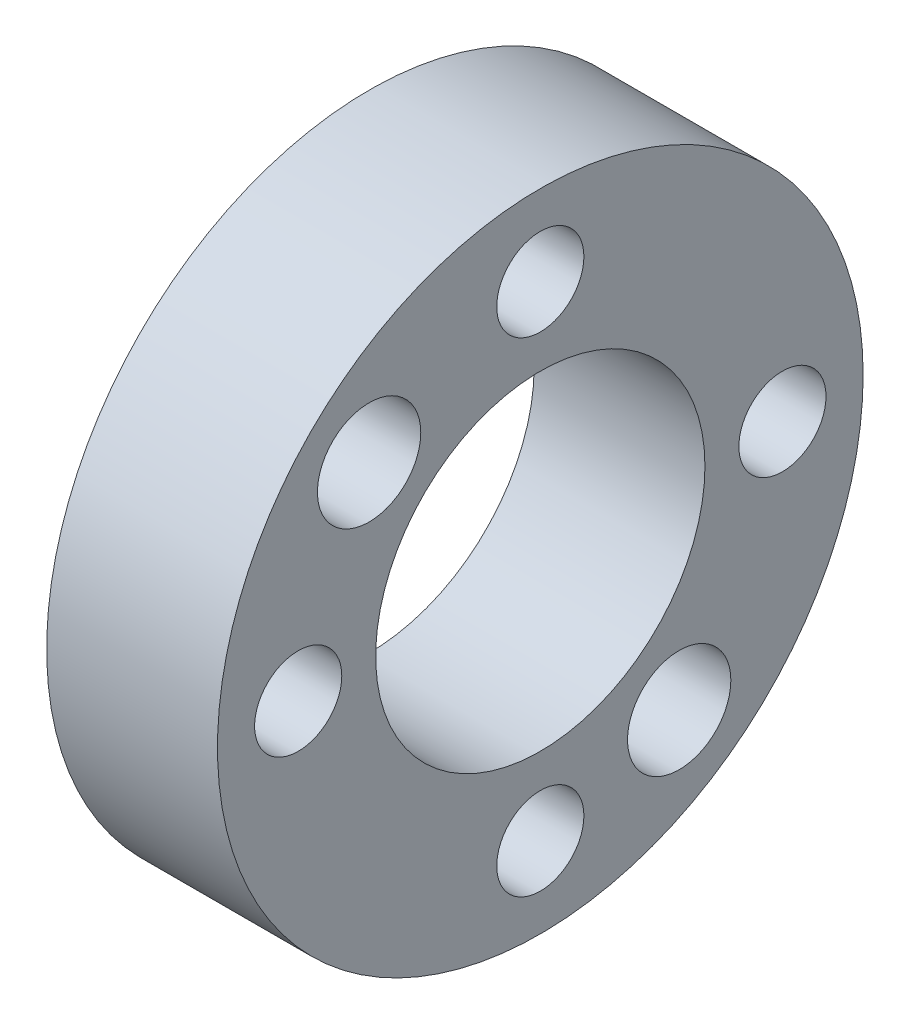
ISO-10303-21;
HEADER;
FILE_DESCRIPTION(('STEP AP214'),'2;1');
FILE_NAME('part.step','',(''),(''),'','','');
FILE_SCHEMA(('AUTOMOTIVE_DESIGN { 1 0 10303 214 1 1 1 1 }'));
ENDSEC;
DATA;
#1=APPLICATION_CONTEXT('core data for automotive mechanical design processes');
#2=APPLICATION_PROTOCOL_DEFINITION('international standard','automotive_design',2000,#1);
#3=PRODUCT_CONTEXT('',#1,'mechanical');
#4=PRODUCT('Part','Part','',(#3));
#5=PRODUCT_RELATED_PRODUCT_CATEGORY('part','',(#4));
#6=PRODUCT_DEFINITION_FORMATION('','',#4);
#7=PRODUCT_DEFINITION_CONTEXT('part definition',#1,'design');
#8=PRODUCT_DEFINITION('design','',#6,#7);
#9=PRODUCT_DEFINITION_SHAPE('','',#8);
#10=(LENGTH_UNIT() NAMED_UNIT(*) SI_UNIT(.MILLI.,.METRE.));
#11=(NAMED_UNIT(*) PLANE_ANGLE_UNIT() SI_UNIT($,.RADIAN.));
#12=(NAMED_UNIT(*) SI_UNIT($,.STERADIAN.) SOLID_ANGLE_UNIT());
#13=UNCERTAINTY_MEASURE_WITH_UNIT(LENGTH_MEASURE(1.E-05),#10,'distance_accuracy_value','');
#14=(GEOMETRIC_REPRESENTATION_CONTEXT(3) GLOBAL_UNCERTAINTY_ASSIGNED_CONTEXT((#13)) GLOBAL_UNIT_ASSIGNED_CONTEXT((#10,
#11,#12)) REPRESENTATION_CONTEXT('',''));
#15=CARTESIAN_POINT('',(0.,0.,0.));
#16=DIRECTION('',(0.,0.,1.));
#17=DIRECTION('',(1.,0.,0.));
#18=AXIS2_PLACEMENT_3D('',#15,#16,#17);
#19=CARTESIAN_POINT('',(0.,5.10000000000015,0.));
#20=DIRECTION('',(-1.,0.,0.));
#21=DIRECTION('',(0.,0.,1.00000000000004));
#22=AXIS2_PLACEMENT_3D('',#19,#20,#21);
#23=PLANE('',#22);
#24=CARTESIAN_POINT('',(0.,-6.14364033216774,-4.30182327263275));
#25=DIRECTION('',(1.,0.,0.));
#26=DIRECTION('',(0.,0.,-1.00000000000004));
#27=AXIS2_PLACEMENT_3D('',#24,#25,#26);
#28=CIRCLE('',#27,1.6);
#29=CARTESIAN_POINT('',(0.,-6.14364033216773,-5.90182327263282));
#30=VERTEX_POINT('',#29);
#31=EDGE_CURVE('E79',#30,#30,#28,.T.);
#32=ORIENTED_EDGE('',*,*,#31,.T.);
#33=EDGE_LOOP('',(#32));
#34=FACE_BOUND('',#33,.T.);
#35=CARTESIAN_POINT('',(0.,5.30330085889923,5.30330085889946));
#36=DIRECTION('',(1.,0.,0.));
#37=DIRECTION('',(0.,0.,-1.00000000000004));
#38=AXIS2_PLACEMENT_3D('',#35,#36,#37);
#39=CIRCLE('',#38,1.6);
#40=CARTESIAN_POINT('',(0.,5.30330085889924,3.70330085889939));
#41=VERTEX_POINT('',#40);
#42=EDGE_CURVE('E75',#41,#41,#39,.T.);
#43=ORIENTED_EDGE('',*,*,#42,.T.);
#44=EDGE_LOOP('',(#43));
#45=FACE_BOUND('',#44,.T.);
#46=CARTESIAN_POINT('',(0.,1.15195735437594E-13,-7.49999999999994));
#47=DIRECTION('',(1.,0.,0.));
#48=DIRECTION('',(0.,0.,-1.00000000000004));
#49=AXIS2_PLACEMENT_3D('',#46,#47,#48);
#50=CIRCLE('',#49,1.35);
#51=CARTESIAN_POINT('',(0.,1.21790460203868E-13,-8.84999999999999));
#52=VERTEX_POINT('',#51);
#53=EDGE_CURVE('E69',#52,#52,#50,.T.);
#54=ORIENTED_EDGE('',*,*,#53,.T.);
#55=EDGE_LOOP('',(#54));
#56=FACE_BOUND('',#55,.T.);
#57=CARTESIAN_POINT('',(0.,-7.5000000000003,0.));
#58=DIRECTION('',(1.,0.,0.));
#59=DIRECTION('',(0.,0.,-1.00000000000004));
#60=AXIS2_PLACEMENT_3D('',#57,#58,#59);
#61=CIRCLE('',#60,1.35);
#62=CARTESIAN_POINT('',(0.,-7.5000000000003,-1.35000000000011));
#63=VERTEX_POINT('',#62);
#64=EDGE_CURVE('E63',#63,#63,#61,.T.);
#65=ORIENTED_EDGE('',*,*,#64,.T.);
#66=EDGE_LOOP('',(#65));
#67=FACE_BOUND('',#66,.T.);
#68=CARTESIAN_POINT('',(0.,0.,7.5000000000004));
#69=DIRECTION('',(1.,0.,0.));
#70=DIRECTION('',(0.,0.,-1.00000000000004));
#71=AXIS2_PLACEMENT_3D('',#68,#69,#70);
#72=CIRCLE('',#71,1.35);
#73=CARTESIAN_POINT('',(0.,0.,6.15000000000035));
#74=VERTEX_POINT('',#73);
#75=EDGE_CURVE('E57',#74,#74,#72,.T.);
#76=ORIENTED_EDGE('',*,*,#75,.T.);
#77=EDGE_LOOP('',(#76));
#78=FACE_BOUND('',#77,.T.);
#79=CARTESIAN_POINT('',(0.,7.5000000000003,0.));
#80=DIRECTION('',(1.,0.,0.));
#81=DIRECTION('',(0.,0.,-1.00000000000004));
#82=AXIS2_PLACEMENT_3D('',#79,#80,#81);
#83=CIRCLE('',#82,1.35);
#84=CARTESIAN_POINT('',(0.,7.50000000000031,-1.35000000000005));
#85=VERTEX_POINT('',#84);
#86=EDGE_CURVE('E51',#85,#85,#83,.T.);
#87=ORIENTED_EDGE('',*,*,#86,.T.);
#88=EDGE_LOOP('',(#87));
#89=FACE_BOUND('',#88,.T.);
#90=CARTESIAN_POINT('',(0.,0.,0.));
#91=DIRECTION('',(1.,0.,0.));
#92=DIRECTION('',(0.,0.,-1.00000000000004));
#93=AXIS2_PLACEMENT_3D('',#90,#91,#92);
#94=CIRCLE('',#93,5.1);
#95=CARTESIAN_POINT('',(0.,0.,-5.1000000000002));
#96=VERTEX_POINT('',#95);
#97=EDGE_CURVE('E46',#96,#96,#94,.T.);
#98=ORIENTED_EDGE('',*,*,#97,.T.);
#99=EDGE_LOOP('',(#98));
#100=FACE_BOUND('',#99,.T.);
#101=CARTESIAN_POINT('',(0.,0.,0.));
#102=DIRECTION('',(1.,0.,0.));
#103=DIRECTION('',(0.,0.,-1.00000000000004));
#104=AXIS2_PLACEMENT_3D('',#101,#102,#103);
#105=CIRCLE('',#104,10.);
#106=CARTESIAN_POINT('',(0.,0.,-10.0000000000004));
#107=VERTEX_POINT('',#106);
#108=EDGE_CURVE('E10',#107,#107,#105,.T.);
#109=ORIENTED_EDGE('',*,*,#108,.F.);
#110=EDGE_LOOP('',(#109));
#111=FACE_BOUND('',#110,.T.);
#112=ADVANCED_FACE('F32',(#34,#45,#56,#67,#78,#89,#100,#111),#23,.T.);
#113=CARTESIAN_POINT('',(0.,0.,0.));
#114=DIRECTION('',(1.,0.,0.));
#115=DIRECTION('',(0.,0.,-1.00000000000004));
#116=AXIS2_PLACEMENT_3D('',#113,#114,#115);
#117=CYLINDRICAL_SURFACE('',#116,10.);
#118=ORIENTED_EDGE('',*,*,#108,.T.);
#119=EDGE_LOOP('',(#118));
#120=FACE_BOUND('',#119,.T.);
#121=CARTESIAN_POINT('',(5.29099999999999,0.,0.));
#122=DIRECTION('',(1.,0.,0.));
#123=DIRECTION('',(0.,0.,-1.00000000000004));
#124=AXIS2_PLACEMENT_3D('',#121,#122,#123);
#125=CIRCLE('',#124,10.);
#126=CARTESIAN_POINT('',(5.29099999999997,0.,-10.0000000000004));
#127=VERTEX_POINT('',#126);
#128=EDGE_CURVE('E38',#127,#127,#125,.T.);
#129=ORIENTED_EDGE('',*,*,#128,.F.);
#130=EDGE_LOOP('',(#129));
#131=FACE_BOUND('',#130,.T.);
#132=ADVANCED_FACE('F101',(#120,#131),#117,.T.);
#133=CARTESIAN_POINT('',(5.29099999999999,5.10000000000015,0.));
#134=DIRECTION('',(1.,0.,0.));
#135=DIRECTION('',(0.,0.,-1.00000000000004));
#136=AXIS2_PLACEMENT_3D('',#133,#134,#135);
#137=PLANE('',#136);
#138=CARTESIAN_POINT('',(5.29099999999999,-6.14364033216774,-4.30182327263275));
#139=DIRECTION('',(1.,0.,0.));
#140=DIRECTION('',(0.,0.,-1.00000000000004));
#141=AXIS2_PLACEMENT_3D('',#138,#139,#140);
#142=CIRCLE('',#141,1.6);
#143=CARTESIAN_POINT('',(5.29099999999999,-6.14364033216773,-5.90182327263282));
#144=VERTEX_POINT('',#143);
#145=EDGE_CURVE('E82',#144,#144,#142,.T.);
#146=ORIENTED_EDGE('',*,*,#145,.F.);
#147=EDGE_LOOP('',(#146));
#148=FACE_BOUND('',#147,.T.);
#149=CARTESIAN_POINT('',(5.29099999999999,5.30330085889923,5.30330085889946));
#150=DIRECTION('',(1.,0.,0.));
#151=DIRECTION('',(0.,0.,-1.00000000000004));
#152=AXIS2_PLACEMENT_3D('',#149,#150,#151);
#153=CIRCLE('',#152,1.6);
#154=CARTESIAN_POINT('',(5.29099999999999,5.30330085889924,3.70330085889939));
#155=VERTEX_POINT('',#154);
#156=EDGE_CURVE('E76',#155,#155,#153,.T.);
#157=ORIENTED_EDGE('',*,*,#156,.F.);
#158=EDGE_LOOP('',(#157));
#159=FACE_BOUND('',#158,.T.);
#160=CARTESIAN_POINT('',(5.29099999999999,1.15195735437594E-13,-7.49999999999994));
#161=DIRECTION('',(1.,0.,0.));
#162=DIRECTION('',(0.,0.,-1.00000000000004));
#163=AXIS2_PLACEMENT_3D('',#160,#161,#162);
#164=CIRCLE('',#163,1.35);
#165=CARTESIAN_POINT('',(5.29099999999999,1.21790460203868E-13,-8.85));
#166=VERTEX_POINT('',#165);
#167=EDGE_CURVE('E72',#166,#166,#164,.T.);
#168=ORIENTED_EDGE('',*,*,#167,.F.);
#169=EDGE_LOOP('',(#168));
#170=FACE_BOUND('',#169,.T.);
#171=CARTESIAN_POINT('',(5.29099999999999,-7.5000000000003,0.));
#172=DIRECTION('',(1.,0.,0.));
#173=DIRECTION('',(0.,0.,-1.00000000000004));
#174=AXIS2_PLACEMENT_3D('',#171,#172,#173);
#175=CIRCLE('',#174,1.35);
#176=CARTESIAN_POINT('',(5.29099999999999,-7.5000000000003,-1.35000000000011));
#177=VERTEX_POINT('',#176);
#178=EDGE_CURVE('E66',#177,#177,#175,.T.);
#179=ORIENTED_EDGE('',*,*,#178,.F.);
#180=EDGE_LOOP('',(#179));
#181=FACE_BOUND('',#180,.T.);
#182=CARTESIAN_POINT('',(5.29099999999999,0.,7.5000000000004));
#183=DIRECTION('',(1.,0.,0.));
#184=DIRECTION('',(0.,0.,-1.00000000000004));
#185=AXIS2_PLACEMENT_3D('',#182,#183,#184);
#186=CIRCLE('',#185,1.35);
#187=CARTESIAN_POINT('',(5.29099999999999,0.,6.15000000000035));
#188=VERTEX_POINT('',#187);
#189=EDGE_CURVE('E60',#188,#188,#186,.T.);
#190=ORIENTED_EDGE('',*,*,#189,.F.);
#191=EDGE_LOOP('',(#190));
#192=FACE_BOUND('',#191,.T.);
#193=CARTESIAN_POINT('',(5.29099999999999,7.5000000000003,0.));
#194=DIRECTION('',(1.,0.,0.));
#195=DIRECTION('',(0.,0.,-1.00000000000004));
#196=AXIS2_PLACEMENT_3D('',#193,#194,#195);
#197=CIRCLE('',#196,1.35);
#198=CARTESIAN_POINT('',(5.29099999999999,7.50000000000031,-1.35000000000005));
#199=VERTEX_POINT('',#198);
#200=EDGE_CURVE('E54',#199,#199,#197,.T.);
#201=ORIENTED_EDGE('',*,*,#200,.F.);
#202=EDGE_LOOP('',(#201));
#203=FACE_BOUND('',#202,.T.);
#204=ORIENTED_EDGE('',*,*,#128,.T.);
#205=EDGE_LOOP('',(#204));
#206=FACE_BOUND('',#205,.T.);
#207=CARTESIAN_POINT('',(5.29099999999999,0.,0.));
#208=DIRECTION('',(1.,0.,0.));
#209=DIRECTION('',(0.,0.,-1.00000000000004));
#210=AXIS2_PLACEMENT_3D('',#207,#208,#209);
#211=CIRCLE('',#210,5.1);
#212=CARTESIAN_POINT('',(5.29099999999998,0.,-5.1000000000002));
#213=VERTEX_POINT('',#212);
#214=EDGE_CURVE('E42',#213,#213,#211,.T.);
#215=ORIENTED_EDGE('',*,*,#214,.F.);
#216=EDGE_LOOP('',(#215));
#217=FACE_BOUND('',#216,.T.);
#218=ADVANCED_FACE('F97',(#148,#159,#170,#181,#192,#203,#206,#217),#137,.T.);
#219=CARTESIAN_POINT('',(0.,0.,0.));
#220=DIRECTION('',(1.,0.,0.));
#221=DIRECTION('',(0.,0.,-1.00000000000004));
#222=AXIS2_PLACEMENT_3D('',#219,#220,#221);
#223=CYLINDRICAL_SURFACE('',#222,5.1);
#224=ORIENTED_EDGE('',*,*,#214,.T.);
#225=EDGE_LOOP('',(#224));
#226=FACE_BOUND('',#225,.T.);
#227=ORIENTED_EDGE('',*,*,#97,.F.);
#228=EDGE_LOOP('',(#227));
#229=FACE_BOUND('',#228,.T.);
#230=ADVANCED_FACE('F100',(#226,#229),#223,.F.);
#231=CARTESIAN_POINT('',(5.29099999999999,7.5000000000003,0.));
#232=DIRECTION('',(1.,0.,0.));
#233=DIRECTION('',(0.,0.,-1.00000000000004));
#234=AXIS2_PLACEMENT_3D('',#231,#232,#233);
#235=CYLINDRICAL_SURFACE('',#234,1.35);
#236=ORIENTED_EDGE('',*,*,#86,.F.);
#237=EDGE_LOOP('',(#236));
#238=FACE_BOUND('',#237,.T.);
#239=ORIENTED_EDGE('',*,*,#200,.T.);
#240=EDGE_LOOP('',(#239));
#241=FACE_BOUND('',#240,.T.);
#242=ADVANCED_FACE('F117',(#238,#241),#235,.F.);
#243=CARTESIAN_POINT('',(5.29099999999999,0.,7.5000000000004));
#244=DIRECTION('',(1.,0.,0.));
#245=DIRECTION('',(0.,0.,-1.00000000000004));
#246=AXIS2_PLACEMENT_3D('',#243,#244,#245);
#247=CYLINDRICAL_SURFACE('',#246,1.35);
#248=ORIENTED_EDGE('',*,*,#75,.F.);
#249=EDGE_LOOP('',(#248));
#250=FACE_BOUND('',#249,.T.);
#251=ORIENTED_EDGE('',*,*,#189,.T.);
#252=EDGE_LOOP('',(#251));
#253=FACE_BOUND('',#252,.T.);
#254=ADVANCED_FACE('F132',(#250,#253),#247,.F.);
#255=CARTESIAN_POINT('',(5.29099999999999,-7.5000000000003,0.));
#256=DIRECTION('',(1.,0.,0.));
#257=DIRECTION('',(0.,0.,-1.00000000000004));
#258=AXIS2_PLACEMENT_3D('',#255,#256,#257);
#259=CYLINDRICAL_SURFACE('',#258,1.35);
#260=ORIENTED_EDGE('',*,*,#64,.F.);
#261=EDGE_LOOP('',(#260));
#262=FACE_BOUND('',#261,.T.);
#263=ORIENTED_EDGE('',*,*,#178,.T.);
#264=EDGE_LOOP('',(#263));
#265=FACE_BOUND('',#264,.T.);
#266=ADVANCED_FACE('F136',(#262,#265),#259,.F.);
#267=CARTESIAN_POINT('',(5.29099999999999,1.15195735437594E-13,-7.49999999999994));
#268=DIRECTION('',(1.,0.,0.));
#269=DIRECTION('',(0.,0.,-1.00000000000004));
#270=AXIS2_PLACEMENT_3D('',#267,#268,#269);
#271=CYLINDRICAL_SURFACE('',#270,1.35);
#272=ORIENTED_EDGE('',*,*,#53,.F.);
#273=EDGE_LOOP('',(#272));
#274=FACE_BOUND('',#273,.T.);
#275=ORIENTED_EDGE('',*,*,#167,.T.);
#276=EDGE_LOOP('',(#275));
#277=FACE_BOUND('',#276,.T.);
#278=ADVANCED_FACE('F140',(#274,#277),#271,.F.);
#279=CARTESIAN_POINT('',(0.,5.30330085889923,5.30330085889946));
#280=DIRECTION('',(1.,0.,0.));
#281=DIRECTION('',(0.,0.,-1.00000000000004));
#282=AXIS2_PLACEMENT_3D('',#279,#280,#281);
#283=CYLINDRICAL_SURFACE('',#282,1.6);
#284=ORIENTED_EDGE('',*,*,#42,.F.);
#285=EDGE_LOOP('',(#284));
#286=FACE_BOUND('',#285,.T.);
#287=ORIENTED_EDGE('',*,*,#156,.T.);
#288=EDGE_LOOP('',(#287));
#289=FACE_BOUND('',#288,.T.);
#290=ADVANCED_FACE('F93',(#286,#289),#283,.F.);
#291=CARTESIAN_POINT('',(0.,-6.14364033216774,-4.30182327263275));
#292=DIRECTION('',(1.,0.,0.));
#293=DIRECTION('',(0.,0.,-1.00000000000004));
#294=AXIS2_PLACEMENT_3D('',#291,#292,#293);
#295=CYLINDRICAL_SURFACE('',#294,1.6);
#296=ORIENTED_EDGE('',*,*,#31,.F.);
#297=EDGE_LOOP('',(#296));
#298=FACE_BOUND('',#297,.T.);
#299=ORIENTED_EDGE('',*,*,#145,.T.);
#300=EDGE_LOOP('',(#299));
#301=FACE_BOUND('',#300,.T.);
#302=ADVANCED_FACE('F90',(#298,#301),#295,.F.);
#303=CLOSED_SHELL('',(#112,#132,#218,#230,#242,#254,#266,#278,#290,#302));
#304=MANIFOLD_SOLID_BREP('B2',#303);
#305=ADVANCED_BREP_SHAPE_REPRESENTATION('',(#18,#304),#14);
#306=SHAPE_DEFINITION_REPRESENTATION(#9,#305);
ENDSEC;
END-ISO-10303-21;
